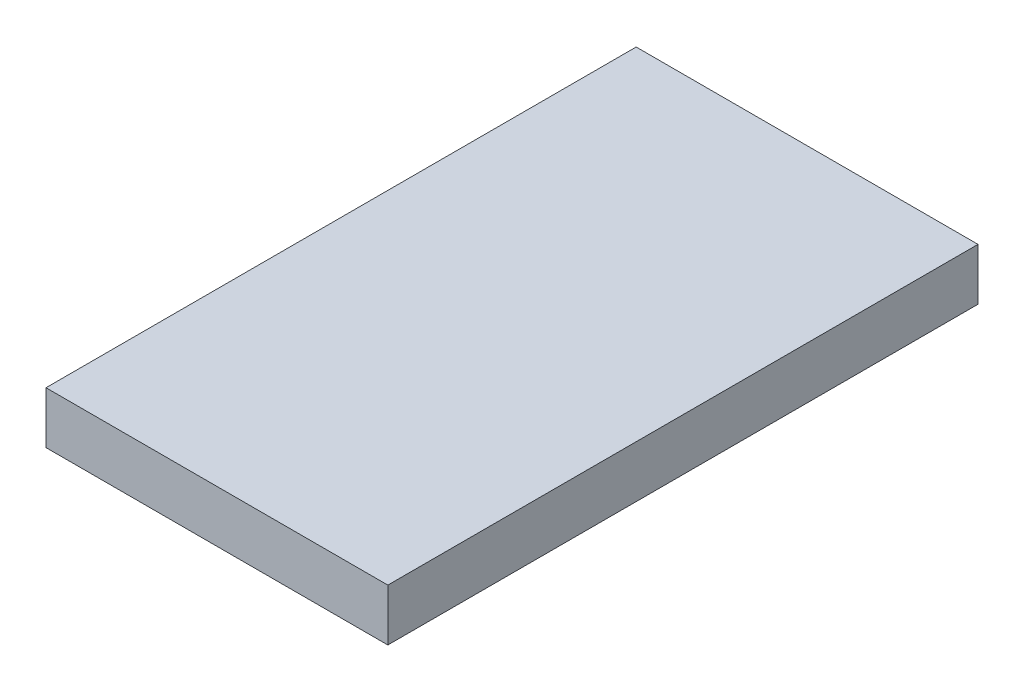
from build123d import *

# Parameters (mm, degrees)
SKETCH1_W      = 334.676590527
SKETCH1_H      = 577.8
EXTRUDE1_DEPTH = 50.8


with BuildPart() as part:
    # Sketch1 → Extrude1 (new body)
    with BuildSketch(Plane.XZ):
        with Locations((-167.338295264, -139.7)):
            Rectangle(SKETCH1_W, SKETCH1_H)
    extrude(amount=EXTRUDE1_DEPTH)


solid = part.part
